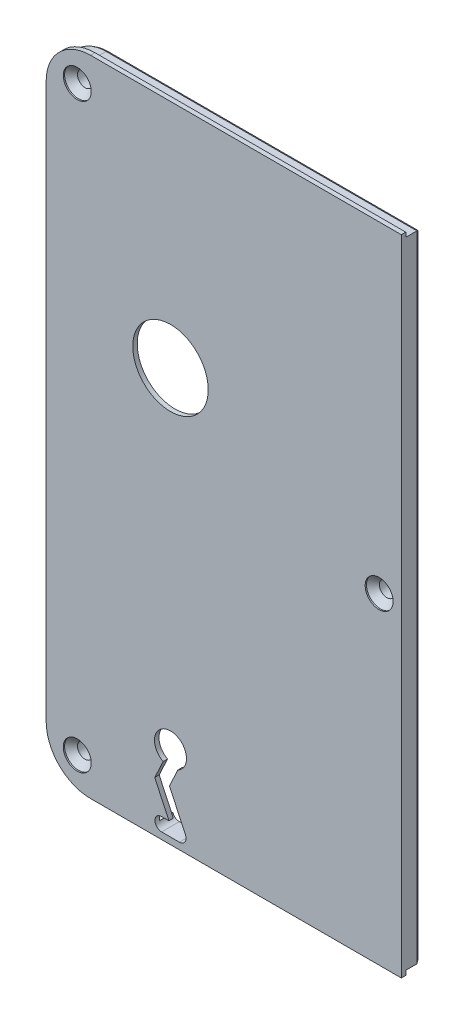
from build123d import *
from OCP.BRepFilletAPI import BRepFilletAPI_MakeChamfer

# Parameters (mm, degrees)
LINEAR_AUSTRAGEN1_DEPTH                     = 1
HALTERAND_DEPTH                             = 3
FORMSENKUNG_F_R_M3_SENKSCHRAUBE_MIT_2_COUNT = 2
FORMSENKUNG_F_R_M3_SENKSCHRAUBE_MIT_2_PITCH = 94.415305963
FORMSENKUNG_F_R_M3_SENKSCHRAUBE_MIT_3_COUNT = 2
FORMSENKUNG_F_R_M3_SENKSCHRAUBE_MIT_3_PITCH = 131
FASE1_SIZE                                  = 0.5
FASE1_SIZE2                                 = 0.288675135
AUSTRAG_F_R_SCHL_SSELLOCH_REACH             = 110.038
AUSTRAG_F_R_NUSS_REACH                      = 110.038
SKIZZE13_R                                  = 8.5


with BuildPart() as part:
    # Skizze1 → Linear austragen1 (new body)
    with BuildSketch(Plane.XY):
        with BuildLine():
            Line((0, -72.5), (0, 72.5))
            Line((0, 72.5), (-70, 72.5))
            ThreePointArc((-70, 72.5), (-77.071067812, 69.571067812), (-80, 62.5))
            Line((-80, 62.5), (-80, -62.5))
            ThreePointArc((-80, -62.5), (-77.071067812, -69.571067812), (-70, -72.5))
            Line((-70, -72.5), (0, -72.5))
        make_face()
    extrude(amount=-LINEAR_AUSTRAGEN1_DEPTH)

    # Skizze9 → Halterand (add)
    with BuildSketch(Plane(origin=(0, 0, -1), x_dir=(-1, 0, 0), z_dir=(0, 0, -1))):
        with BuildLine():
            Line((70, 71.5), (0, 71.5))
            Line((0, 71.5), (0, -71.5))
            Line((0, -71.5), (70, -71.5))
            ThreePointArc((70, -71.5), (76.363961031, -68.863961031), (79, -62.5))
            Line((79, -62.5), (79, 62.5))
            ThreePointArc((79, 62.5), (76.363961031, 68.863961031), (70, 71.5))
        make_face()
        Polygon((1.5, 70), (1.5, 5), (10, 5), (10, -5), (1.5, -5), (1.5, -70), (69, -70), (69, -61.5), (77.5, -61.5), (77.5, 61.5), (69, 61.5), (69, 70), align=None, mode=Mode.SUBTRACT)
    extrude(amount=HALTERAND_DEPTH)

    # Skizze11 → Formsenkung f_r M3 Senkschraube mit Schl (revolve, cut)
    with BuildSketch(Plane(origin=(-73, 65.5, 0), x_dir=(0, -1, 0), z_dir=(1, 0, 0))):
        Polygon((0, 0), (0, 4.000025), (1.725, 4.000025), (1.7, 3.975025), (1.7, 1.75), (3.15, 0.3), (3.15, 0), align=None)
    formsenkung_f_r_m3_senkschraube_mit_schl = revolve(axis=Axis((-73, 65.5, 6.35), (0, 0, -1)), mode=Mode.SUBTRACT)

    # Formsenkung f_r M3 Senkschraube mit  2: Formsenkung f_r M3 Senkschraube mit Schl ×2
    with Locations(*[Vector(0.7202222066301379, -0.6937434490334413, 0) * (i * FORMSENKUNG_F_R_M3_SENKSCHRAUBE_MIT_2_PITCH) for i in range(1, FORMSENKUNG_F_R_M3_SENKSCHRAUBE_MIT_2_COUNT)]):
        add(formsenkung_f_r_m3_senkschraube_mit_schl, mode=Mode.SUBTRACT)

    # Formsenkung f_r M3 Senkschraube mit  3: Formsenkung f_r M3 Senkschraube mit Schl ×2
    with Locations(*[(0, -i * FORMSENKUNG_F_R_M3_SENKSCHRAUBE_MIT_3_PITCH, 0) for i in range(1, FORMSENKUNG_F_R_M3_SENKSCHRAUBE_MIT_3_COUNT)]):
        add(formsenkung_f_r_m3_senkschraube_mit_schl, mode=Mode.SUBTRACT)

    # Fase1: one chamfer whose edges measure the first distance from different faces: ONE call of the kernel's chamfer builder (chamfer() names one face for all edges)
    fase1_edges_1 = [part.edges().sort_by_distance(p)[0] for p in [
        (-35, 71.5, -4),
    ]]
    fase1_side_1 = [part.faces().sort_by_distance(p)[0] for p in [
        (-35, 71.5, -2.5),
    ]]
    fase1_edges_2 = [part.edges().sort_by_distance(p)[0] for p in [
        (-76.363961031, 68.863961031, -4),
    ]]
    fase1_side_2 = [part.faces().sort_by_distance(p)[0] for p in [
        (-76.363961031, 68.863961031, -2.5),
    ]]
    fase1_edges_3 = [part.edges().sort_by_distance(p)[0] for p in [
        (0, 0, -4),
    ]]
    fase1_side_3 = [part.faces().sort_by_distance(p)[0] for p in [
        (0, 0, -1.994773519),
    ]]
    fase1_edges_4 = [part.edges().sort_by_distance(p)[0] for p in [
        (-35, -71.5, -4),
    ]]
    fase1_side_4 = [part.faces().sort_by_distance(p)[0] for p in [
        (-35, -71.5, -2.5),
    ]]
    fase1_edges_5 = [part.edges().sort_by_distance(p)[0] for p in [
        (-76.363961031, -68.863961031, -4),
    ]]
    fase1_side_5 = [part.faces().sort_by_distance(p)[0] for p in [
        (-76.363961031, -68.863961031, -2.5),
    ]]
    fase1_edges_6 = [part.edges().sort_by_distance(p)[0] for p in [
        (-79, 0, -4),
    ]]
    fase1_side_6 = [part.faces().sort_by_distance(p)[0] for p in [
        (-79, 0, -2.5),
    ]]
    fase1 = BRepFilletAPI_MakeChamfer(part.part.solid().wrapped)
    for e in fase1_edges_1:
        fase1.Add(FASE1_SIZE, FASE1_SIZE2, e.wrapped, fase1_side_1[0].wrapped)  # the first distance lies on this face
    for e in fase1_edges_2:
        fase1.Add(FASE1_SIZE, FASE1_SIZE2, e.wrapped, fase1_side_2[0].wrapped)  # the first distance lies on this face
    for e in fase1_edges_3:
        fase1.Add(FASE1_SIZE, FASE1_SIZE2, e.wrapped, fase1_side_3[0].wrapped)  # the first distance lies on this face
    for e in fase1_edges_4:
        fase1.Add(FASE1_SIZE, FASE1_SIZE2, e.wrapped, fase1_side_4[0].wrapped)  # the first distance lies on this face
    for e in fase1_edges_5:
        fase1.Add(FASE1_SIZE, FASE1_SIZE2, e.wrapped, fase1_side_5[0].wrapped)  # the first distance lies on this face
    for e in fase1_edges_6:
        fase1.Add(FASE1_SIZE, FASE1_SIZE2, e.wrapped, fase1_side_6[0].wrapped)  # the first distance lies on this face
    add(Compound.cast(fase1.Shape()), mode=Mode.REPLACE)

    # Skizze12 → Austrag f_r Schl_sselloch (cut, up to next)
    with BuildSketch(Plane(origin=(0, 0, 0), x_dir=(-1, 0, 0), z_dir=(0, 0, -1)), mode=Mode.PRIVATE) as austrag_f_r_schl_sselloch_sk1:
        with BuildLine():
            Line((50.344933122, -57.09699134), (52.236742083, -61.153988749))
            Line((52.236742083, -61.153988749), (48.640538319, -68.866072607))
            ThreePointArc((48.640538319, -68.866072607), (48.734912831, -70.305949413), (50, -71))
            Line((50, -71), (54, -71))
            ThreePointArc((54, -71), (55.5, -69.5), (54, -68))
            Line((54, -68), (52.354528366, -68))
            Line((52.354528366, -68), (55.54687584, -61.153988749))
            Line((55.54687584, -61.153988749), (53.655066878, -57.09699134))
            ThreePointArc((53.655066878, -57.09699134), (52, -50.3), (50.344933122, -57.09699134))
        make_face()
    austrag_f_r_schl_sselloch_tool1 = extrude(austrag_f_r_schl_sselloch_sk1.sketch, amount=AUSTRAG_F_R_SCHL_SSELLOCH_REACH, mode=Mode.PRIVATE) & part.part
    add(austrag_f_r_schl_sselloch_tool1.solids().sort_by_distance((-52.199262, -60.299778, 0))[0], mode=Mode.SUBTRACT)

    # Skizze13 → Austrag f_r Nuss (cut, up to next)
    with BuildSketch(Plane.XY, mode=Mode.PRIVATE) as austrag_f_r_nuss_sk1:
        with Locations((-52, 20.5)):
            Circle(SKIZZE13_R)
    austrag_f_r_nuss_tool1 = extrude(austrag_f_r_nuss_sk1.sketch, amount=-AUSTRAG_F_R_NUSS_REACH, mode=Mode.PRIVATE) & part.part
    add(austrag_f_r_nuss_tool1.solids().sort_by_distance((-52, 20.5, 0))[0], mode=Mode.SUBTRACT)


solid = part.part
